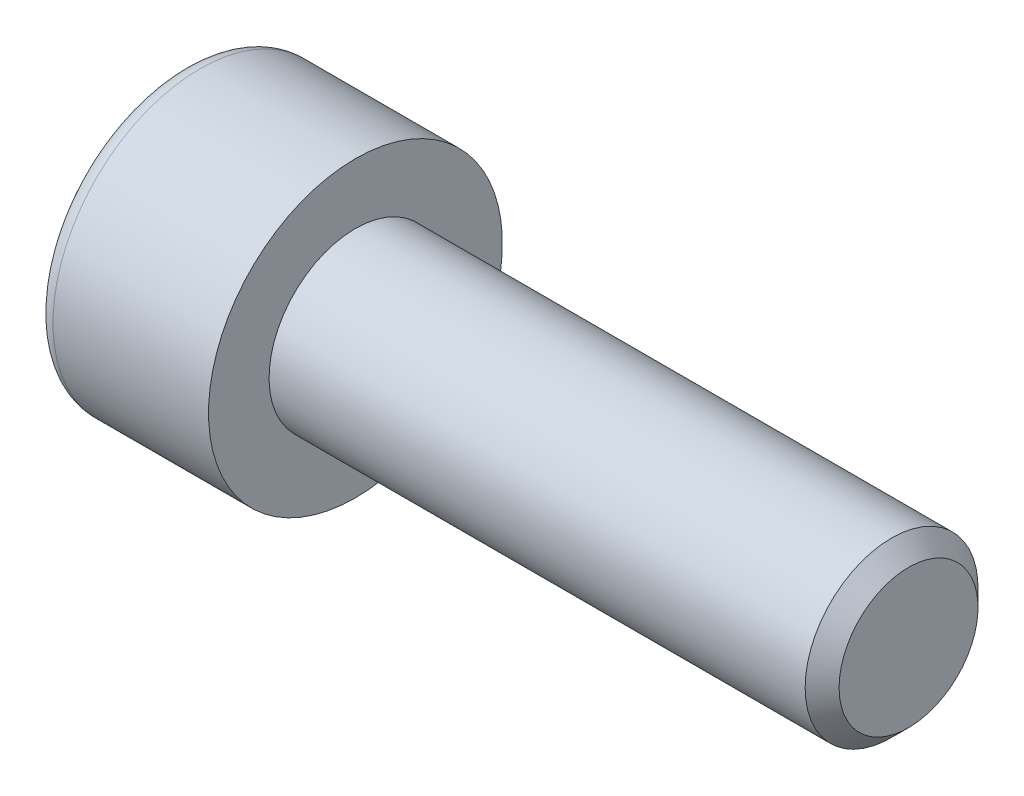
ISO-10303-21;
HEADER;
FILE_DESCRIPTION(('STEP AP214'),'2;1');
FILE_NAME('part.step','',(''),(''),'','','');
FILE_SCHEMA(('AUTOMOTIVE_DESIGN { 1 0 10303 214 1 1 1 1 }'));
ENDSEC;
DATA;
#1=APPLICATION_CONTEXT('core data for automotive mechanical design processes');
#2=APPLICATION_PROTOCOL_DEFINITION('international standard','automotive_design',2000,#1);
#3=PRODUCT_CONTEXT('',#1,'mechanical');
#4=PRODUCT('Part','Part','',(#3));
#5=PRODUCT_RELATED_PRODUCT_CATEGORY('part','',(#4));
#6=PRODUCT_DEFINITION_FORMATION('','',#4);
#7=PRODUCT_DEFINITION_CONTEXT('part definition',#1,'design');
#8=PRODUCT_DEFINITION('design','',#6,#7);
#9=PRODUCT_DEFINITION_SHAPE('','',#8);
#10=(LENGTH_UNIT() NAMED_UNIT(*) SI_UNIT(.MILLI.,.METRE.));
#11=(NAMED_UNIT(*) PLANE_ANGLE_UNIT() SI_UNIT($,.RADIAN.));
#12=(NAMED_UNIT(*) SI_UNIT($,.STERADIAN.) SOLID_ANGLE_UNIT());
#13=UNCERTAINTY_MEASURE_WITH_UNIT(LENGTH_MEASURE(1.E-05),#10,'distance_accuracy_value','');
#14=(GEOMETRIC_REPRESENTATION_CONTEXT(3) GLOBAL_UNCERTAINTY_ASSIGNED_CONTEXT((#13)) GLOBAL_UNIT_ASSIGNED_CONTEXT((#10,
#11,#12)) REPRESENTATION_CONTEXT('',''));
#15=CARTESIAN_POINT('',(0.,0.,0.));
#16=DIRECTION('',(0.,0.,1.));
#17=DIRECTION('',(1.,0.,0.));
#18=AXIS2_PLACEMENT_3D('',#15,#16,#17);
#19=CARTESIAN_POINT('',(-2.50800000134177,0.,0.));
#20=DIRECTION('',(-1.,0.,0.));
#21=DIRECTION('',(0.,0.,1.));
#22=AXIS2_PLACEMENT_3D('',#19,#20,#21);
#23=CONICAL_SURFACE('',#22,2.32325748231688,1.04719754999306);
#24=CARTESIAN_POINT('',(-1.16666666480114,0.,0.));
#25=VERTEX_POINT('',#24);
#26=VERTEX_LOOP('',#25);
#27=FACE_BOUND('',#26,.T.);
#28=CARTESIAN_POINT('',(-2.50000000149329,2.00000000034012,1.15470053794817));
#29=CARTESIAN_POINT('',(-2.4706955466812,2.00000000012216,1.05321634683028));
#30=CARTESIAN_POINT('',(-2.44404467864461,2.00000000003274,0.950856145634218));
#31=CARTESIAN_POINT('',(-2.39752638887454,1.99999999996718,0.744363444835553));
#32=CARTESIAN_POINT('',(-2.37767542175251,1.99999999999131,0.640227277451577));
#33=CARTESIAN_POINT('',(-2.34677596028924,2.00000000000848,0.433245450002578));
#34=CARTESIAN_POINT('',(-2.33552178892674,2.00000000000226,0.330431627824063));
#35=CARTESIAN_POINT('',(-2.32208916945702,1.99999999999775,0.124320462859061));
#36=CARTESIAN_POINT('',(-2.31989959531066,1.99999999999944,0.0210238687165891));
#37=CARTESIAN_POINT('',(-2.32446629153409,2.00000000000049,-0.171974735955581));
#38=CARTESIAN_POINT('',(-2.33010128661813,2.00000000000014,-0.261705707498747));
#39=CARTESIAN_POINT('',(-2.34795730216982,1.99999999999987,-0.440583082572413));
#40=CARTESIAN_POINT('',(-2.36018441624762,1.99999999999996,-0.52972886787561));
#41=CARTESIAN_POINT('',(-2.39074983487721,2.00000000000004,-0.708974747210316));
#42=CARTESIAN_POINT('',(-2.40921764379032,2.00000000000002,-0.799052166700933));
#43=CARTESIAN_POINT('',(-2.45113176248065,1.99999999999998,-0.977863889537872));
#44=CARTESIAN_POINT('',(-2.47456823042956,1.99999999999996,-1.06660048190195));
#45=CARTESIAN_POINT('',(-2.50000000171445,2.,-1.15470053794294));
#46=B_SPLINE_CURVE_WITH_KNOTS('',3,(#28,#29,#30,#31,#32,#33,#34,#35,#36,#37,#38,#39,#40,#41,#42,
#43,#44,#45),.UNSPECIFIED.,.F.,.F.,(4,2,2,2,2,2,2,2,4),(0.,0.317016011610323,0.634793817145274,
0.944707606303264,1.25424088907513,1.5237077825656,1.79342419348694,2.06912162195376,
2.34427797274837),.UNSPECIFIED.);
#47=CARTESIAN_POINT('',(-2.50000000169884,1.99999999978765,1.15470053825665));
#48=VERTEX_POINT('',#47);
#49=CARTESIAN_POINT('',(-2.50000000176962,2.,-1.15470053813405));
#50=VERTEX_POINT('',#49);
#51=EDGE_CURVE('E19',#48,#50,#46,.T.);
#52=ORIENTED_EDGE('',*,*,#51,.T.);
#53=CARTESIAN_POINT('',(-2.50000000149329,1.99999999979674,-1.15470053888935));
#54=CARTESIAN_POINT('',(-2.4706955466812,1.91211211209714,-1.20544263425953));
#55=CARTESIAN_POINT('',(-2.44404467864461,1.82346557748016,-1.25662273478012));
#56=CARTESIAN_POINT('',(-2.39752638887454,1.64463765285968,-1.35986908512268));
#57=CARTESIAN_POINT('',(-2.37767542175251,1.55445308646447,-1.41193716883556));
#58=CARTESIAN_POINT('',(-2.34677596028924,1.37520156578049,-1.51542808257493));
#59=CARTESIAN_POINT('',(-2.33552178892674,1.28616218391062,-1.5668349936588));
#60=CARTESIAN_POINT('',(-2.32208916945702,1.10766467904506,-1.66989057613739));
#61=CARTESIAN_POINT('',(-2.31989959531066,1.01820720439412,-1.72153887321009));
#62=CARTESIAN_POINT('',(-2.32446629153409,0.851065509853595,-1.81803817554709));
#63=CARTESIAN_POINT('',(-2.33010128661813,0.773356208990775,-1.86290366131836));
#64=CARTESIAN_POINT('',(-2.34795730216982,0.61844385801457,-1.95234234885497));
#65=CARTESIAN_POINT('',(-2.36018441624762,0.541241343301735,-1.99691524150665));
#66=CARTESIAN_POINT('',(-2.39074983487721,0.386009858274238,-2.08653818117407));
#67=CARTESIAN_POINT('',(-2.40921764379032,0.308000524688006,-2.13157689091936));
#68=CARTESIAN_POINT('',(-2.45113176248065,0.153145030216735,-2.2209827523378));
#69=CARTESIAN_POINT('',(-2.47456823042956,0.0762968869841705,-2.26535104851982));
#70=CARTESIAN_POINT('',(-2.50000000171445,3.77862391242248E-10,-2.30940107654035));
#71=B_SPLINE_CURVE_WITH_KNOTS('',3,(#53,#54,#55,#56,#57,#58,#59,#60,#61,#62,#63,#64,#65,#66,#67,
#68,#69,#70),.UNSPECIFIED.,.F.,.F.,(4,2,2,2,2,2,2,2,4),(0.,0.317016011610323,0.634793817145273,
0.944707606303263,1.25424088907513,1.5237077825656,1.79342419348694,2.06912162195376,
2.34427797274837),.UNSPECIFIED.);
#72=CARTESIAN_POINT('',(-2.50000000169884,0.,-2.3094010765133));
#73=VERTEX_POINT('',#72);
#74=EDGE_CURVE('E79',#50,#73,#71,.T.);
#75=ORIENTED_EDGE('',*,*,#74,.T.);
#76=CARTESIAN_POINT('',(-2.50000000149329,-5.43384326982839E-10,-2.30940107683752));
#77=CARTESIAN_POINT('',(-2.4706955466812,-0.0878878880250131,-2.25865898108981));
#78=CARTESIAN_POINT('',(-2.44404467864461,-0.176534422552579,-2.20747888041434));
#79=CARTESIAN_POINT('',(-2.39752638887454,-0.355362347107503,-2.10423252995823));
#80=CARTESIAN_POINT('',(-2.37767542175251,-0.44554691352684,-2.05216444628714));
#81=CARTESIAN_POINT('',(-2.34677596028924,-0.624798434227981,-1.94867353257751));
#82=CARTESIAN_POINT('',(-2.33552178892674,-0.713837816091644,-1.89726662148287));
#83=CARTESIAN_POINT('',(-2.32208916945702,-0.892335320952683,-1.79421103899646));
#84=CARTESIAN_POINT('',(-2.31989959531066,-0.981792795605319,-1.74256274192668));
#85=CARTESIAN_POINT('',(-2.32446629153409,-1.1489344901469,-1.64606343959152));
#86=CARTESIAN_POINT('',(-2.33010128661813,-1.22664379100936,-1.60119795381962));
#87=CARTESIAN_POINT('',(-2.34795730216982,-1.3815561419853,-1.51175926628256));
#88=CARTESIAN_POINT('',(-2.36018441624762,-1.45875865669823,-1.46718637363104));
#89=CARTESIAN_POINT('',(-2.39074983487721,-1.6139901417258,-1.37756343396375));
#90=CARTESIAN_POINT('',(-2.40921764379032,-1.69199947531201,-1.33252472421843));
#91=CARTESIAN_POINT('',(-2.45113176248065,-1.84685496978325,-1.24311886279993));
#92=CARTESIAN_POINT('',(-2.47456823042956,-1.92370311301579,-1.19875056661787));
#93=CARTESIAN_POINT('',(-2.50000000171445,-1.99999999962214,-1.15470053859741));
#94=B_SPLINE_CURVE_WITH_KNOTS('',3,(#76,#77,#78,#79,#80,#81,#82,#83,#84,#85,#86,#87,#88,#89,#90,
#91,#92,#93),.UNSPECIFIED.,.F.,.F.,(4,2,2,2,2,2,2,2,4),(0.,0.317016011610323,0.634793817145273,
0.944707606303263,1.25424088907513,1.5237077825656,1.79342419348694,2.06912162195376,
2.34427797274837),.UNSPECIFIED.);
#95=CARTESIAN_POINT('',(-2.50000000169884,-1.99999999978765,-1.15470053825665));
#96=VERTEX_POINT('',#95);
#97=EDGE_CURVE('E104',#73,#96,#94,.T.);
#98=ORIENTED_EDGE('',*,*,#97,.T.);
#99=CARTESIAN_POINT('',(-2.50000000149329,-2.00000000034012,-1.15470053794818));
#100=CARTESIAN_POINT('',(-2.4706955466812,-2.00000000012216,-1.05321634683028));
#101=CARTESIAN_POINT('',(-2.44404467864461,-2.00000000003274,-0.950856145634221));
#102=CARTESIAN_POINT('',(-2.39752638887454,-1.99999999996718,-0.744363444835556));
#103=CARTESIAN_POINT('',(-2.37767542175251,-1.99999999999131,-0.64022727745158));
#104=CARTESIAN_POINT('',(-2.34677596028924,-2.00000000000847,-0.433245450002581));
#105=CARTESIAN_POINT('',(-2.33552178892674,-2.00000000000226,-0.330431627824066));
#106=CARTESIAN_POINT('',(-2.32208916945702,-1.99999999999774,-0.124320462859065));
#107=CARTESIAN_POINT('',(-2.31989959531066,-1.99999999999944,-0.0210238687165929));
#108=CARTESIAN_POINT('',(-2.32446629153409,-2.00000000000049,0.171974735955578));
#109=CARTESIAN_POINT('',(-2.33010128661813,-2.00000000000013,0.261705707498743));
#110=CARTESIAN_POINT('',(-2.34795730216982,-1.99999999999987,0.44058308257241));
#111=CARTESIAN_POINT('',(-2.36018441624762,-1.99999999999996,0.529728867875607));
#112=CARTESIAN_POINT('',(-2.39074983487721,-2.00000000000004,0.708974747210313));
#113=CARTESIAN_POINT('',(-2.40921764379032,-2.00000000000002,0.79905216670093));
#114=CARTESIAN_POINT('',(-2.45113176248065,-1.99999999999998,0.97786388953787));
#115=CARTESIAN_POINT('',(-2.47456823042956,-1.99999999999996,1.06660048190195));
#116=CARTESIAN_POINT('',(-2.50000000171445,-2.,1.15470053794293));
#117=B_SPLINE_CURVE_WITH_KNOTS('',3,(#99,#100,#101,#102,#103,#104,#105,#106,#107,#108,#109,#110,
#111,#112,#113,#114,#115,#116),.UNSPECIFIED.,.F.,.F.,(4,2,2,2,2,2,2,2,4),(0.,0.317016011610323,
0.634793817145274,0.944707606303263,1.25424088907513,1.5237077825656,1.79342419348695,
2.06912162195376,2.34427797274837),.UNSPECIFIED.);
#118=CARTESIAN_POINT('',(-2.50000000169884,-1.99999999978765,1.15470053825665));
#119=VERTEX_POINT('',#118);
#120=EDGE_CURVE('E128',#96,#119,#117,.T.);
#121=ORIENTED_EDGE('',*,*,#120,.T.);
#122=CARTESIAN_POINT('',(-2.50000000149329,-1.99999999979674,1.15470053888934));
#123=CARTESIAN_POINT('',(-2.4706955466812,-1.91211211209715,1.20544263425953));
#124=CARTESIAN_POINT('',(-2.44404467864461,-1.82346557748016,1.25662273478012));
#125=CARTESIAN_POINT('',(-2.39752638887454,-1.64463765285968,1.35986908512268));
#126=CARTESIAN_POINT('',(-2.37767542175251,-1.55445308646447,1.41193716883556));
#127=CARTESIAN_POINT('',(-2.34677596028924,-1.37520156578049,1.51542808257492));
#128=CARTESIAN_POINT('',(-2.33552178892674,-1.28616218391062,1.5668349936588));
#129=CARTESIAN_POINT('',(-2.32208916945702,-1.10766467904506,1.66989057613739));
#130=CARTESIAN_POINT('',(-2.31989959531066,-1.01820720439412,1.72153887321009));
#131=CARTESIAN_POINT('',(-2.32446629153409,-0.851065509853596,1.81803817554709));
#132=CARTESIAN_POINT('',(-2.33010128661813,-0.773356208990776,1.86290366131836));
#133=CARTESIAN_POINT('',(-2.34795730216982,-0.61844385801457,1.95234234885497));
#134=CARTESIAN_POINT('',(-2.36018441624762,-0.541241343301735,1.99691524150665));
#135=CARTESIAN_POINT('',(-2.39074983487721,-0.386009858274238,2.08653818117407));
#136=CARTESIAN_POINT('',(-2.40921764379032,-0.308000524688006,2.13157689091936));
#137=CARTESIAN_POINT('',(-2.45113176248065,-0.153145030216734,2.2209827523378));
#138=CARTESIAN_POINT('',(-2.47456823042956,-0.0762968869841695,2.26535104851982));
#139=CARTESIAN_POINT('',(-2.50000000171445,-3.77861126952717E-10,2.30940107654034));
#140=B_SPLINE_CURVE_WITH_KNOTS('',3,(#122,#123,#124,#125,#126,#127,#128,#129,#130,#131,#132,
#133,#134,#135,#136,#137,#138,#139),.UNSPECIFIED.,.F.,.F.,(4,2,2,2,2,2,2,2,4),(0.,
0.317016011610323,0.634793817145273,0.944707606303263,1.25424088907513,1.5237077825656,
1.79342419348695,2.06912162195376,2.34427797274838),.UNSPECIFIED.);
#141=CARTESIAN_POINT('',(-2.50000000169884,0.,2.3094010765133));
#142=VERTEX_POINT('',#141);
#143=EDGE_CURVE('E136',#119,#142,#140,.T.);
#144=ORIENTED_EDGE('',*,*,#143,.T.);
#145=CARTESIAN_POINT('',(-2.50000000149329,5.4338462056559E-10,2.30940107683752));
#146=CARTESIAN_POINT('',(-2.47069554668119,0.0878878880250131,2.25865898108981));
#147=CARTESIAN_POINT('',(-2.44404467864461,0.176534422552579,2.20747888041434));
#148=CARTESIAN_POINT('',(-2.39752638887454,0.355362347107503,2.10423252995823));
#149=CARTESIAN_POINT('',(-2.37767542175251,0.44554691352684,2.05216444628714));
#150=CARTESIAN_POINT('',(-2.34677596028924,0.624798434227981,1.9486735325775));
#151=CARTESIAN_POINT('',(-2.33552178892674,0.713837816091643,1.89726662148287));
#152=CARTESIAN_POINT('',(-2.32208916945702,0.892335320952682,1.79421103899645));
#153=CARTESIAN_POINT('',(-2.31989959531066,0.981792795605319,1.74256274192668));
#154=CARTESIAN_POINT('',(-2.32446629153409,1.1489344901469,1.64606343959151));
#155=CARTESIAN_POINT('',(-2.33010128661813,1.22664379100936,1.60119795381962));
#156=CARTESIAN_POINT('',(-2.34795730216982,1.3815561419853,1.51175926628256));
#157=CARTESIAN_POINT('',(-2.36018441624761,1.45875865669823,1.46718637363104));
#158=CARTESIAN_POINT('',(-2.39074983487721,1.6139901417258,1.37756343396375));
#159=CARTESIAN_POINT('',(-2.40921764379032,1.69199947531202,1.33252472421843));
#160=CARTESIAN_POINT('',(-2.45113176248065,1.84685496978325,1.24311886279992));
#161=CARTESIAN_POINT('',(-2.47456823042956,1.92370311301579,1.19875056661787));
#162=CARTESIAN_POINT('',(-2.50000000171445,1.99999999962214,1.15470053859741));
#163=B_SPLINE_CURVE_WITH_KNOTS('',3,(#145,#146,#147,#148,#149,#150,#151,#152,#153,#154,#155,
#156,#157,#158,#159,#160,#161,#162),.UNSPECIFIED.,.F.,.F.,(4,2,2,2,2,2,2,2,4),(0.,
0.317016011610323,0.634793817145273,0.944707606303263,1.25424088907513,1.5237077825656,
1.79342419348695,2.06912162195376,2.34427797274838),.UNSPECIFIED.);
#164=EDGE_CURVE('E81',#142,#48,#163,.T.);
#165=ORIENTED_EDGE('',*,*,#164,.T.);
#166=EDGE_LOOP('',(#52,#75,#98,#121,#144,#165));
#167=FACE_BOUND('',#166,.T.);
#168=ADVANCED_FACE('F15',(#27,#167),#23,.F.);
#169=CARTESIAN_POINT('',(-5.,2.,1.15470053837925));
#170=DIRECTION('',(0.,1.,0.));
#171=DIRECTION('',(0.,0.,1.));
#172=AXIS2_PLACEMENT_3D('',#169,#170,#171);
#173=PLANE('',#172);
#174=DIRECTION('',(1.,0.,0.));
#175=VECTOR('',#174,1.);
#176=CARTESIAN_POINT('',(-5.,2.,1.15470053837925));
#177=LINE('',#176,#175);
#178=CARTESIAN_POINT('',(-5.,2.,1.15470053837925));
#179=VERTEX_POINT('',#178);
#180=EDGE_CURVE('E83',#48,#179,#177,.F.);
#181=ORIENTED_EDGE('',*,*,#180,.T.);
#182=DIRECTION('',(0.,0.,1.));
#183=VECTOR('',#182,1.);
#184=CARTESIAN_POINT('',(-5.,2.,0.));
#185=LINE('',#184,#183);
#186=CARTESIAN_POINT('',(-5.,2.,-1.15470053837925));
#187=VERTEX_POINT('',#186);
#188=EDGE_CURVE('E88',#187,#179,#185,.T.);
#189=ORIENTED_EDGE('',*,*,#188,.F.);
#190=DIRECTION('',(1.,0.,0.));
#191=VECTOR('',#190,1.);
#192=CARTESIAN_POINT('',(-5.,2.,-1.15470053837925));
#193=LINE('',#192,#191);
#194=EDGE_CURVE('E86',#187,#50,#193,.T.);
#195=ORIENTED_EDGE('',*,*,#194,.T.);
#196=ORIENTED_EDGE('',*,*,#51,.F.);
#197=EDGE_LOOP('',(#181,#189,#195,#196));
#198=FACE_BOUND('',#197,.T.);
#199=ADVANCED_FACE('F75',(#198),#173,.F.);
#200=CARTESIAN_POINT('',(-5.,0.,2.3094010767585));
#201=DIRECTION('',(0.,0.500000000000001,0.866025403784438));
#202=DIRECTION('',(0.,-0.866025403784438,0.500000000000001));
#203=AXIS2_PLACEMENT_3D('',#200,#201,#202);
#204=PLANE('',#203);
#205=DIRECTION('',(1.,0.,0.));
#206=VECTOR('',#205,1.);
#207=CARTESIAN_POINT('',(-5.,0.,2.3094010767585));
#208=LINE('',#207,#206);
#209=CARTESIAN_POINT('',(-5.,0.,2.3094010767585));
#210=VERTEX_POINT('',#209);
#211=EDGE_CURVE('E140',#142,#210,#208,.F.);
#212=ORIENTED_EDGE('',*,*,#211,.T.);
#213=DIRECTION('',(0.,-0.866025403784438,0.5));
#214=VECTOR('',#213,1.);
#215=CARTESIAN_POINT('',(-5.,2.,1.15470053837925));
#216=LINE('',#215,#214);
#217=EDGE_CURVE('E94',#179,#210,#216,.T.);
#218=ORIENTED_EDGE('',*,*,#217,.F.);
#219=ORIENTED_EDGE('',*,*,#180,.F.);
#220=ORIENTED_EDGE('',*,*,#164,.F.);
#221=EDGE_LOOP('',(#212,#218,#219,#220));
#222=FACE_BOUND('',#221,.T.);
#223=ADVANCED_FACE('F144',(#222),#204,.F.);
#224=CARTESIAN_POINT('',(-5.,-2.,1.15470053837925));
#225=DIRECTION('',(0.,-0.5,0.866025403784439));
#226=DIRECTION('',(0.,-0.866025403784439,-0.5));
#227=AXIS2_PLACEMENT_3D('',#224,#225,#226);
#228=PLANE('',#227);
#229=DIRECTION('',(1.,0.,0.));
#230=VECTOR('',#229,1.);
#231=CARTESIAN_POINT('',(-5.,-2.,1.15470053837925));
#232=LINE('',#231,#230);
#233=CARTESIAN_POINT('',(-5.,-2.,1.15470053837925));
#234=VERTEX_POINT('',#233);
#235=EDGE_CURVE('E135',#119,#234,#232,.F.);
#236=ORIENTED_EDGE('',*,*,#235,.T.);
#237=DIRECTION('',(0.,-0.866025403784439,-0.5));
#238=VECTOR('',#237,1.);
#239=CARTESIAN_POINT('',(-5.,0.,2.3094010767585));
#240=LINE('',#239,#238);
#241=EDGE_CURVE('E223',#210,#234,#240,.T.);
#242=ORIENTED_EDGE('',*,*,#241,.F.);
#243=ORIENTED_EDGE('',*,*,#211,.F.);
#244=ORIENTED_EDGE('',*,*,#143,.F.);
#245=EDGE_LOOP('',(#236,#242,#243,#244));
#246=FACE_BOUND('',#245,.T.);
#247=ADVANCED_FACE('F124',(#246),#228,.F.);
#248=CARTESIAN_POINT('',(-5.,-2.,-1.15470053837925));
#249=DIRECTION('',(0.,-1.,0.));
#250=DIRECTION('',(0.,0.,-1.));
#251=AXIS2_PLACEMENT_3D('',#248,#249,#250);
#252=PLANE('',#251);
#253=DIRECTION('',(1.,0.,0.));
#254=VECTOR('',#253,1.);
#255=CARTESIAN_POINT('',(-5.,-2.,-1.15470053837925));
#256=LINE('',#255,#254);
#257=CARTESIAN_POINT('',(-5.,-2.,-1.15470053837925));
#258=VERTEX_POINT('',#257);
#259=EDGE_CURVE('E134',#96,#258,#256,.F.);
#260=ORIENTED_EDGE('',*,*,#259,.T.);
#261=DIRECTION('',(0.,0.,1.));
#262=VECTOR('',#261,1.);
#263=CARTESIAN_POINT('',(-5.,-2.,0.));
#264=LINE('',#263,#262);
#265=EDGE_CURVE('E220',#234,#258,#264,.F.);
#266=ORIENTED_EDGE('',*,*,#265,.F.);
#267=ORIENTED_EDGE('',*,*,#235,.F.);
#268=ORIENTED_EDGE('',*,*,#120,.F.);
#269=EDGE_LOOP('',(#260,#266,#267,#268));
#270=FACE_BOUND('',#269,.T.);
#271=ADVANCED_FACE('F120',(#270),#252,.F.);
#272=CARTESIAN_POINT('',(-5.,0.,-2.3094010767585));
#273=DIRECTION('',(0.,-0.5,-0.866025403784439));
#274=DIRECTION('',(0.,0.866025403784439,-0.5));
#275=AXIS2_PLACEMENT_3D('',#272,#273,#274);
#276=PLANE('',#275);
#277=DIRECTION('',(1.,0.,0.));
#278=VECTOR('',#277,1.);
#279=CARTESIAN_POINT('',(-5.,0.,-2.3094010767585));
#280=LINE('',#279,#278);
#281=CARTESIAN_POINT('',(-5.,0.,-2.3094010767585));
#282=VERTEX_POINT('',#281);
#283=EDGE_CURVE('E37',#73,#282,#280,.F.);
#284=ORIENTED_EDGE('',*,*,#283,.T.);
#285=DIRECTION('',(0.,0.866025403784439,-0.5));
#286=VECTOR('',#285,1.);
#287=CARTESIAN_POINT('',(-5.,-2.,-1.15470053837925));
#288=LINE('',#287,#286);
#289=EDGE_CURVE('E217',#258,#282,#288,.T.);
#290=ORIENTED_EDGE('',*,*,#289,.F.);
#291=ORIENTED_EDGE('',*,*,#259,.F.);
#292=ORIENTED_EDGE('',*,*,#97,.F.);
#293=EDGE_LOOP('',(#284,#290,#291,#292));
#294=FACE_BOUND('',#293,.T.);
#295=ADVANCED_FACE('F114',(#294),#276,.F.);
#296=CARTESIAN_POINT('',(-5.,2.,-1.15470053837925));
#297=DIRECTION('',(0.,0.5,-0.866025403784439));
#298=DIRECTION('',(0.,0.866025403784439,0.5));
#299=AXIS2_PLACEMENT_3D('',#296,#297,#298);
#300=PLANE('',#299);
#301=ORIENTED_EDGE('',*,*,#194,.F.);
#302=DIRECTION('',(0.,0.866025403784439,0.499999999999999));
#303=VECTOR('',#302,1.);
#304=CARTESIAN_POINT('',(-5.,0.,-2.3094010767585));
#305=LINE('',#304,#303);
#306=EDGE_CURVE('E215',#282,#187,#305,.T.);
#307=ORIENTED_EDGE('',*,*,#306,.F.);
#308=ORIENTED_EDGE('',*,*,#283,.F.);
#309=ORIENTED_EDGE('',*,*,#74,.F.);
#310=EDGE_LOOP('',(#301,#307,#308,#309));
#311=FACE_BOUND('',#310,.T.);
#312=ADVANCED_FACE('F92',(#311),#300,.F.);
#313=CARTESIAN_POINT('',(-5.,3.27970053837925,0.));
#314=DIRECTION('',(-1.,0.,0.));
#315=DIRECTION('',(0.,0.,1.));
#316=AXIS2_PLACEMENT_3D('',#313,#314,#315);
#317=PLANE('',#316);
#318=ORIENTED_EDGE('',*,*,#289,.T.);
#319=ORIENTED_EDGE('',*,*,#306,.T.);
#320=ORIENTED_EDGE('',*,*,#188,.T.);
#321=ORIENTED_EDGE('',*,*,#217,.T.);
#322=ORIENTED_EDGE('',*,*,#241,.T.);
#323=ORIENTED_EDGE('',*,*,#265,.T.);
#324=EDGE_LOOP('',(#318,#319,#320,#321,#322,#323));
#325=FACE_BOUND('',#324,.T.);
#326=CARTESIAN_POINT('',(-5.,0.,0.));
#327=DIRECTION('',(1.,0.,0.));
#328=DIRECTION('',(0.,1.,0.));
#329=AXIS2_PLACEMENT_3D('',#326,#327,#328);
#330=CIRCLE('',#329,3.75);
#331=CARTESIAN_POINT('',(-5.,3.75,0.));
#332=VERTEX_POINT('',#331);
#333=EDGE_CURVE('E192',#332,#332,#330,.T.);
#334=ORIENTED_EDGE('',*,*,#333,.F.);
#335=EDGE_LOOP('',(#334));
#336=FACE_BOUND('',#335,.T.);
#337=ADVANCED_FACE('F113',(#325,#336),#317,.T.);
#338=CARTESIAN_POINT('',(-4.5,0.,0.));
#339=DIRECTION('',(1.,0.,0.));
#340=DIRECTION('',(0.,0.,-1.));
#341=AXIS2_PLACEMENT_3D('',#338,#339,#340);
#342=TOROIDAL_SURFACE('',#341,3.75,0.5);
#343=CARTESIAN_POINT('',(-4.5,0.,0.));
#344=DIRECTION('',(1.,0.,0.));
#345=DIRECTION('',(0.,1.,0.));
#346=AXIS2_PLACEMENT_3D('',#343,#344,#345);
#347=CIRCLE('',#346,4.25);
#348=CARTESIAN_POINT('',(-4.5,4.25,0.));
#349=VERTEX_POINT('',#348);
#350=EDGE_CURVE('E233',#349,#349,#347,.T.);
#351=ORIENTED_EDGE('',*,*,#350,.F.);
#352=EDGE_LOOP('',(#351));
#353=FACE_BOUND('',#352,.T.);
#354=ORIENTED_EDGE('',*,*,#333,.T.);
#355=EDGE_LOOP('',(#354));
#356=FACE_BOUND('',#355,.T.);
#357=ADVANCED_FACE('F176',(#353,#356),#342,.T.);
#358=CARTESIAN_POINT('',(-2.5,0.,0.));
#359=DIRECTION('',(1.,0.,0.));
#360=DIRECTION('',(0.,1.,0.));
#361=AXIS2_PLACEMENT_3D('',#358,#359,#360);
#362=CYLINDRICAL_SURFACE('',#361,4.25);
#363=ORIENTED_EDGE('',*,*,#350,.T.);
#364=EDGE_LOOP('',(#363));
#365=FACE_BOUND('',#364,.T.);
#366=CARTESIAN_POINT('',(0.,0.,0.));
#367=DIRECTION('',(1.,0.,0.));
#368=DIRECTION('',(0.,1.,0.));
#369=AXIS2_PLACEMENT_3D('',#366,#367,#368);
#370=CIRCLE('',#369,4.25);
#371=CARTESIAN_POINT('',(0.,4.25,0.));
#372=VERTEX_POINT('',#371);
#373=EDGE_CURVE('E102',#372,#372,#370,.T.);
#374=ORIENTED_EDGE('',*,*,#373,.F.);
#375=EDGE_LOOP('',(#374));
#376=FACE_BOUND('',#375,.T.);
#377=ADVANCED_FACE('F173',(#365,#376),#362,.T.);
#378=CARTESIAN_POINT('',(16.,1.25,0.));
#379=DIRECTION('',(1.,0.,0.));
#380=DIRECTION('',(0.,0.,-1.));
#381=AXIS2_PLACEMENT_3D('',#378,#379,#380);
#382=PLANE('',#381);
#383=CARTESIAN_POINT('',(16.0000000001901,0.,0.));
#384=DIRECTION('',(-1.,0.,0.));
#385=DIRECTION('',(0.,0.,1.));
#386=AXIS2_PLACEMENT_3D('',#383,#384,#385);
#387=CIRCLE('',#386,2.00924000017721);
#388=CARTESIAN_POINT('',(16.0000000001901,0.,2.00924000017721));
#389=VERTEX_POINT('',#388);
#390=EDGE_CURVE('E229',#389,#389,#387,.T.);
#391=ORIENTED_EDGE('',*,*,#390,.F.);
#392=EDGE_LOOP('',(#391));
#393=FACE_BOUND('',#392,.T.);
#394=ADVANCED_FACE('F169',(#393),#382,.T.);
#395=CARTESIAN_POINT('',(0.,3.375,0.));
#396=DIRECTION('',(1.,0.,0.));
#397=DIRECTION('',(0.,0.,-1.));
#398=AXIS2_PLACEMENT_3D('',#395,#396,#397);
#399=PLANE('',#398);
#400=CARTESIAN_POINT('',(0.,0.,0.));
#401=DIRECTION('',(1.,0.,0.));
#402=DIRECTION('',(0.,1.,0.));
#403=AXIS2_PLACEMENT_3D('',#400,#401,#402);
#404=CIRCLE('',#403,2.5);
#405=CARTESIAN_POINT('',(0.,2.5,0.));
#406=VERTEX_POINT('',#405);
#407=EDGE_CURVE('E28',#406,#406,#404,.T.);
#408=ORIENTED_EDGE('',*,*,#407,.F.);
#409=EDGE_LOOP('',(#408));
#410=FACE_BOUND('',#409,.T.);
#411=ORIENTED_EDGE('',*,*,#373,.T.);
#412=EDGE_LOOP('',(#411));
#413=FACE_BOUND('',#412,.T.);
#414=ADVANCED_FACE('F162',(#410,#413),#399,.T.);
#415=CARTESIAN_POINT('',(15.509239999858,0.,0.));
#416=DIRECTION('',(-1.,0.,0.));
#417=DIRECTION('',(0.,0.,1.));
#418=AXIS2_PLACEMENT_3D('',#415,#416,#417);
#419=CONICAL_SURFACE('',#418,2.49999999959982,0.78539816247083);
#420=ORIENTED_EDGE('',*,*,#390,.T.);
#421=EDGE_LOOP('',(#420));
#422=FACE_BOUND('',#421,.T.);
#423=CARTESIAN_POINT('',(15.50924,0.,0.));
#424=DIRECTION('',(1.,0.,0.));
#425=DIRECTION('',(0.,1.,0.));
#426=AXIS2_PLACEMENT_3D('',#423,#424,#425);
#427=CIRCLE('',#426,2.5);
#428=CARTESIAN_POINT('',(15.50924,2.5,0.));
#429=VERTEX_POINT('',#428);
#430=EDGE_CURVE('E10',#429,#429,#427,.F.);
#431=ORIENTED_EDGE('',*,*,#430,.F.);
#432=EDGE_LOOP('',(#431));
#433=FACE_BOUND('',#432,.T.);
#434=ADVANCED_FACE('F155',(#422,#433),#419,.T.);
#435=CARTESIAN_POINT('',(9.00000000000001,0.,0.));
#436=DIRECTION('',(1.,0.,0.));
#437=DIRECTION('',(0.,1.,0.));
#438=AXIS2_PLACEMENT_3D('',#435,#436,#437);
#439=CYLINDRICAL_SURFACE('',#438,2.5);
#440=ORIENTED_EDGE('',*,*,#430,.T.);
#441=EDGE_LOOP('',(#440));
#442=FACE_BOUND('',#441,.T.);
#443=ORIENTED_EDGE('',*,*,#407,.T.);
#444=EDGE_LOOP('',(#443));
#445=FACE_BOUND('',#444,.T.);
#446=ADVANCED_FACE('F153',(#442,#445),#439,.T.);
#447=CLOSED_SHELL('',(#168,#199,#223,#247,#271,#295,#312,#337,#357,#377,#394,#414,#434,#446));
#448=MANIFOLD_SOLID_BREP('B1',#447);
#449=ADVANCED_BREP_SHAPE_REPRESENTATION('',(#18,#448),#14);
#450=SHAPE_DEFINITION_REPRESENTATION(#9,#449);
ENDSEC;
END-ISO-10303-21;
